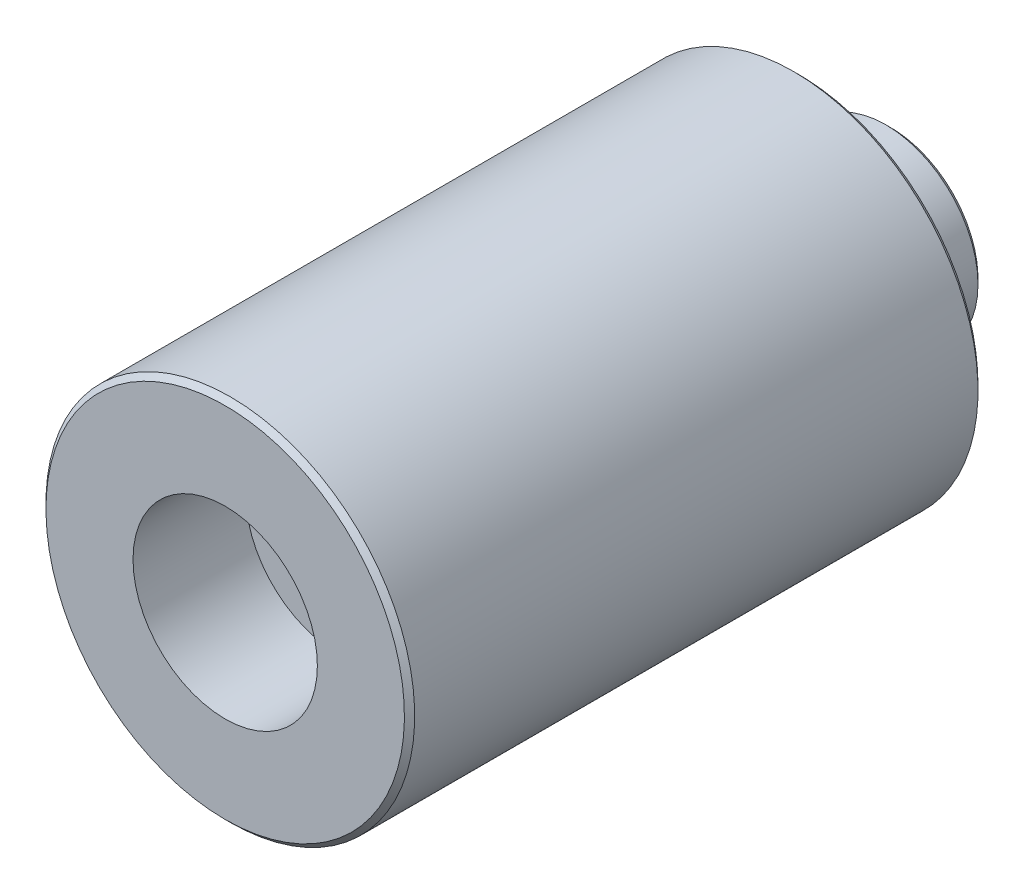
from build123d import *


with BuildPart() as part:
    # Sketch1 → Revolve1 (revolve)
    with BuildSketch(Plane(origin=(0, 0, 0), x_dir=(0, 0, -1), z_dir=(1, 0, 0)), mode=Mode.PRIVATE) as revolve1_sk:
        Polygon((0, 9), (0, 17.5), (0.5, 18), (55.5, 18), (56, 17.5), (56, 9), (64.5, 9), (65, 8.5), (65, 5.5), (11, 5.5), (11, 9), align=None)
    revolve(revolve1_sk.sketch.rotate(Axis((0, 0, 0), (0, 0, -1)), 180), axis=Axis((0, 0, 0), (0, 0, -1)))


solid = part.part
